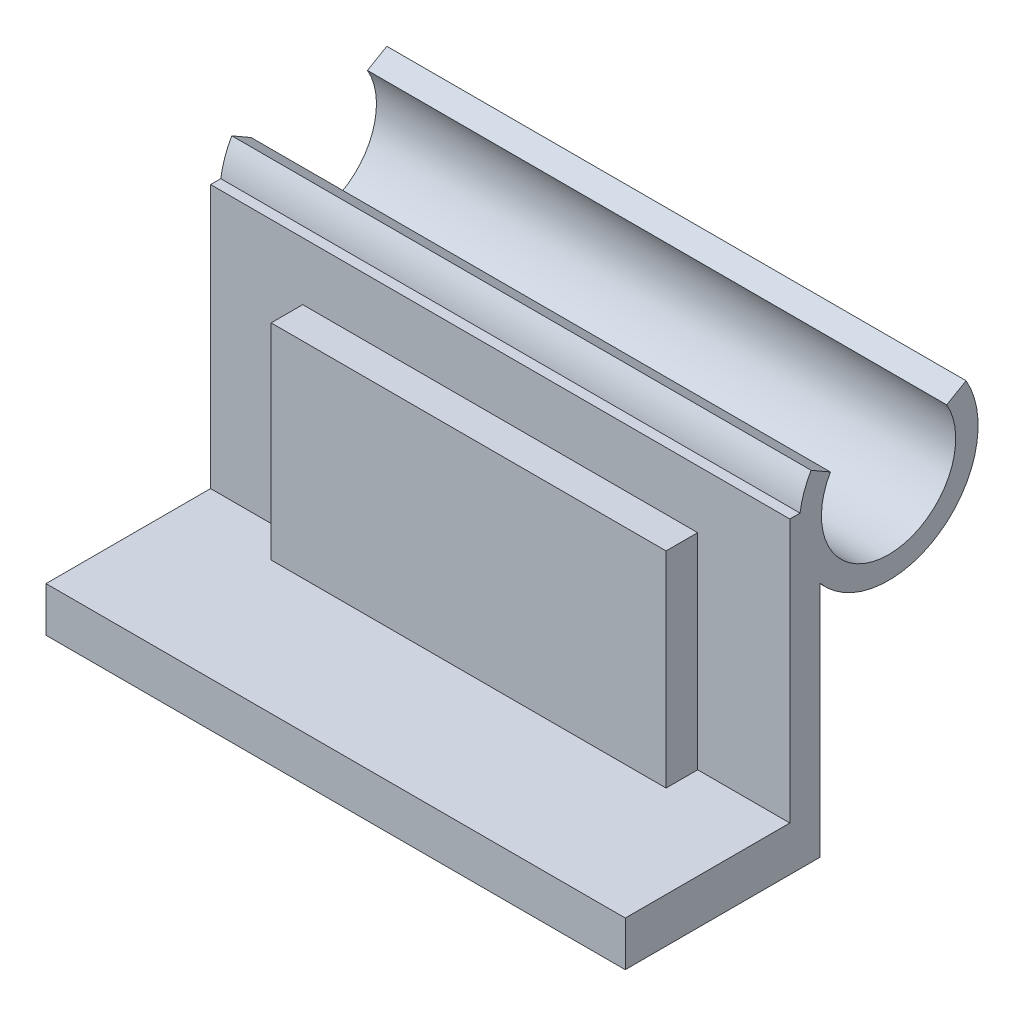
ISO-10303-21;
HEADER;
FILE_DESCRIPTION(('STEP AP214'),'2;1');
FILE_NAME('part.step','',(''),(''),'','','');
FILE_SCHEMA(('AUTOMOTIVE_DESIGN { 1 0 10303 214 1 1 1 1 }'));
ENDSEC;
DATA;
#1=APPLICATION_CONTEXT('core data for automotive mechanical design processes');
#2=APPLICATION_PROTOCOL_DEFINITION('international standard','automotive_design',2000,#1);
#3=PRODUCT_CONTEXT('',#1,'mechanical');
#4=PRODUCT('Part','Part','',(#3));
#5=PRODUCT_RELATED_PRODUCT_CATEGORY('part','',(#4));
#6=PRODUCT_DEFINITION_FORMATION('','',#4);
#7=PRODUCT_DEFINITION_CONTEXT('part definition',#1,'design');
#8=PRODUCT_DEFINITION('design','',#6,#7);
#9=PRODUCT_DEFINITION_SHAPE('','',#8);
#10=(LENGTH_UNIT() NAMED_UNIT(*) SI_UNIT(.MILLI.,.METRE.));
#11=(NAMED_UNIT(*) PLANE_ANGLE_UNIT() SI_UNIT($,.RADIAN.));
#12=(NAMED_UNIT(*) SI_UNIT($,.STERADIAN.) SOLID_ANGLE_UNIT());
#13=UNCERTAINTY_MEASURE_WITH_UNIT(LENGTH_MEASURE(1.E-05),#10,'distance_accuracy_value','');
#14=(GEOMETRIC_REPRESENTATION_CONTEXT(3) GLOBAL_UNCERTAINTY_ASSIGNED_CONTEXT((#13)) GLOBAL_UNIT_ASSIGNED_CONTEXT((#10,
#11,#12)) REPRESENTATION_CONTEXT('',''));
#15=CARTESIAN_POINT('',(0.,0.,0.));
#16=DIRECTION('',(0.,0.,1.));
#17=DIRECTION('',(1.,0.,0.));
#18=AXIS2_PLACEMENT_3D('',#15,#16,#17);
#19=CARTESIAN_POINT('',(-11.,0.5,3.75));
#20=DIRECTION('',(0.,0.,1.));
#21=DIRECTION('',(1.,0.,0.));
#22=AXIS2_PLACEMENT_3D('',#19,#20,#21);
#23=PLANE('',#22);
#24=DIRECTION('',(-1.,0.,0.));
#25=VECTOR('',#24,1.);
#26=CARTESIAN_POINT('',(-11.,-9.5,3.75));
#27=LINE('',#26,#25);
#28=CARTESIAN_POINT('',(-7.5,-9.5,3.75));
#29=VERTEX_POINT('',#28);
#30=CARTESIAN_POINT('',(-11.,-9.5,3.75));
#31=VERTEX_POINT('',#30);
#32=EDGE_CURVE('E237',#29,#31,#27,.T.);
#33=ORIENTED_EDGE('',*,*,#32,.F.);
#34=DIRECTION('',(0.,1.,0.));
#35=VECTOR('',#34,1.);
#36=CARTESIAN_POINT('',(-7.5,-9.5,3.75));
#37=LINE('',#36,#35);
#38=CARTESIAN_POINT('',(-7.5,-1.7,3.75));
#39=VERTEX_POINT('',#38);
#40=EDGE_CURVE('E53',#29,#39,#37,.T.);
#41=ORIENTED_EDGE('',*,*,#40,.T.);
#42=DIRECTION('',(1.,0.,0.));
#43=VECTOR('',#42,1.);
#44=CARTESIAN_POINT('',(-7.5,-1.7,3.75));
#45=LINE('',#44,#43);
#46=CARTESIAN_POINT('',(7.5,-1.7,3.75));
#47=VERTEX_POINT('',#46);
#48=EDGE_CURVE('E57',#39,#47,#45,.T.);
#49=ORIENTED_EDGE('',*,*,#48,.T.);
#50=DIRECTION('',(0.,1.,0.));
#51=VECTOR('',#50,1.);
#52=CARTESIAN_POINT('',(7.5,-9.5,3.75));
#53=LINE('',#52,#51);
#54=CARTESIAN_POINT('',(7.5,-9.5,3.75));
#55=VERTEX_POINT('',#54);
#56=EDGE_CURVE('E214',#55,#47,#53,.T.);
#57=ORIENTED_EDGE('',*,*,#56,.F.);
#58=CARTESIAN_POINT('',(11.,-9.5,3.75));
#59=VERTEX_POINT('',#58);
#60=EDGE_CURVE('E240',#59,#55,#27,.T.);
#61=ORIENTED_EDGE('',*,*,#60,.F.);
#62=DIRECTION('',(0.,-1.,0.));
#63=VECTOR('',#62,1.);
#64=CARTESIAN_POINT('',(11.,0.5,3.75));
#65=LINE('',#64,#63);
#66=CARTESIAN_POINT('',(11.,0.5,3.75));
#67=VERTEX_POINT('',#66);
#68=EDGE_CURVE('E242',#67,#59,#65,.T.);
#69=ORIENTED_EDGE('',*,*,#68,.F.);
#70=DIRECTION('',(1.,0.,0.));
#71=VECTOR('',#70,1.);
#72=CARTESIAN_POINT('',(-11.,0.5,3.75));
#73=LINE('',#72,#71);
#74=CARTESIAN_POINT('',(-11.,0.5,3.75));
#75=VERTEX_POINT('',#74);
#76=EDGE_CURVE('E11',#75,#67,#73,.T.);
#77=ORIENTED_EDGE('',*,*,#76,.F.);
#78=DIRECTION('',(0.,-1.,0.));
#79=VECTOR('',#78,1.);
#80=CARTESIAN_POINT('',(-11.,0.5,3.75));
#81=LINE('',#80,#79);
#82=EDGE_CURVE('E243',#75,#31,#81,.T.);
#83=ORIENTED_EDGE('',*,*,#82,.T.);
#84=EDGE_LOOP('',(#33,#41,#49,#57,#61,#69,#77,#83));
#85=FACE_BOUND('',#84,.T.);
#86=ADVANCED_FACE('F39',(#85),#23,.T.);
#87=CARTESIAN_POINT('',(-11.,-9.5,10.));
#88=DIRECTION('',(0.,1.,0.));
#89=DIRECTION('',(0.,0.,1.));
#90=AXIS2_PLACEMENT_3D('',#87,#88,#89);
#91=PLANE('',#90);
#92=DIRECTION('',(1.,0.,0.));
#93=VECTOR('',#92,1.);
#94=CARTESIAN_POINT('',(-7.5,-9.5,4.95));
#95=LINE('',#94,#93);
#96=CARTESIAN_POINT('',(-7.5,-9.5,4.95));
#97=VERTEX_POINT('',#96);
#98=CARTESIAN_POINT('',(7.5,-9.5,4.95));
#99=VERTEX_POINT('',#98);
#100=EDGE_CURVE('E208',#97,#99,#95,.T.);
#101=ORIENTED_EDGE('',*,*,#100,.F.);
#102=DIRECTION('',(0.,0.,-1.));
#103=VECTOR('',#102,1.);
#104=CARTESIAN_POINT('',(-7.5,-9.5,4.95));
#105=LINE('',#104,#103);
#106=EDGE_CURVE('E201',#97,#29,#105,.T.);
#107=ORIENTED_EDGE('',*,*,#106,.T.);
#108=ORIENTED_EDGE('',*,*,#32,.T.);
#109=DIRECTION('',(0.,0.,1.));
#110=VECTOR('',#109,1.);
#111=CARTESIAN_POINT('',(-11.,-9.5,10.));
#112=LINE('',#111,#110);
#113=CARTESIAN_POINT('',(-11.,-9.5,10.));
#114=VERTEX_POINT('',#113);
#115=EDGE_CURVE('E227',#31,#114,#112,.T.);
#116=ORIENTED_EDGE('',*,*,#115,.T.);
#117=DIRECTION('',(1.,0.,0.));
#118=VECTOR('',#117,1.);
#119=CARTESIAN_POINT('',(-11.,-9.5,10.));
#120=LINE('',#119,#118);
#121=CARTESIAN_POINT('',(11.,-9.5,10.));
#122=VERTEX_POINT('',#121);
#123=EDGE_CURVE('E234',#114,#122,#120,.T.);
#124=ORIENTED_EDGE('',*,*,#123,.T.);
#125=DIRECTION('',(0.,0.,1.));
#126=VECTOR('',#125,1.);
#127=CARTESIAN_POINT('',(11.,-9.5,10.));
#128=LINE('',#127,#126);
#129=EDGE_CURVE('E228',#59,#122,#128,.T.);
#130=ORIENTED_EDGE('',*,*,#129,.F.);
#131=ORIENTED_EDGE('',*,*,#60,.T.);
#132=DIRECTION('',(0.,0.,-1.));
#133=VECTOR('',#132,1.);
#134=CARTESIAN_POINT('',(7.5,-9.5,4.95));
#135=LINE('',#134,#133);
#136=EDGE_CURVE('E211',#99,#55,#135,.T.);
#137=ORIENTED_EDGE('',*,*,#136,.F.);
#138=EDGE_LOOP('',(#101,#107,#108,#116,#124,#130,#131,#137));
#139=FACE_BOUND('',#138,.T.);
#140=ADVANCED_FACE('F274',(#139),#91,.T.);
#141=CARTESIAN_POINT('',(-11.,0.5,2.6));
#142=DIRECTION('',(0.,1.,0.));
#143=DIRECTION('',(0.,0.,1.));
#144=AXIS2_PLACEMENT_3D('',#141,#142,#143);
#145=PLANE('',#144);
#146=DIRECTION('',(1.,0.,0.));
#147=VECTOR('',#146,1.);
#148=CARTESIAN_POINT('',(-11.,0.5,3.36303434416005));
#149=LINE('',#148,#147);
#150=CARTESIAN_POINT('',(-11.,0.5,3.36303434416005));
#151=VERTEX_POINT('',#150);
#152=CARTESIAN_POINT('',(11.,0.5,3.36303434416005));
#153=VERTEX_POINT('',#152);
#154=EDGE_CURVE('E195',#151,#153,#149,.T.);
#155=ORIENTED_EDGE('',*,*,#154,.F.);
#156=DIRECTION('',(0.,0.,1.));
#157=VECTOR('',#156,1.);
#158=CARTESIAN_POINT('',(-11.,0.5,2.6));
#159=LINE('',#158,#157);
#160=EDGE_CURVE('E252',#151,#75,#159,.T.);
#161=ORIENTED_EDGE('',*,*,#160,.T.);
#162=ORIENTED_EDGE('',*,*,#76,.T.);
#163=DIRECTION('',(0.,0.,1.));
#164=VECTOR('',#163,1.);
#165=CARTESIAN_POINT('',(11.,0.5,2.6));
#166=LINE('',#165,#164);
#167=EDGE_CURVE('E247',#153,#67,#166,.T.);
#168=ORIENTED_EDGE('',*,*,#167,.F.);
#169=EDGE_LOOP('',(#155,#161,#162,#168));
#170=FACE_BOUND('',#169,.T.);
#171=ADVANCED_FACE('F270',(#170),#145,.T.);
#172=CARTESIAN_POINT('',(-11.,-11.2,2.6));
#173=DIRECTION('',(0.,0.,-1.));
#174=DIRECTION('',(-1.,0.,0.));
#175=AXIS2_PLACEMENT_3D('',#172,#173,#174);
#176=PLANE('',#175);
#177=DIRECTION('',(1.,0.,0.));
#178=VECTOR('',#177,1.);
#179=CARTESIAN_POINT('',(-11.,-2.19089023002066,2.6));
#180=LINE('',#179,#178);
#181=CARTESIAN_POINT('',(11.,-2.19089023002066,2.6));
#182=VERTEX_POINT('',#181);
#183=CARTESIAN_POINT('',(-11.,-2.19089023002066,2.6));
#184=VERTEX_POINT('',#183);
#185=EDGE_CURVE('E151',#182,#184,#180,.F.);
#186=ORIENTED_EDGE('',*,*,#185,.F.);
#187=DIRECTION('',(0.,1.,0.));
#188=VECTOR('',#187,1.);
#189=CARTESIAN_POINT('',(11.,-11.2,2.6));
#190=LINE('',#189,#188);
#191=CARTESIAN_POINT('',(11.,-11.2,2.6));
#192=VERTEX_POINT('',#191);
#193=EDGE_CURVE('E259',#192,#182,#190,.T.);
#194=ORIENTED_EDGE('',*,*,#193,.F.);
#195=DIRECTION('',(1.,0.,0.));
#196=VECTOR('',#195,1.);
#197=CARTESIAN_POINT('',(-11.,-11.2,2.6));
#198=LINE('',#197,#196);
#199=CARTESIAN_POINT('',(-11.,-11.2,2.6));
#200=VERTEX_POINT('',#199);
#201=EDGE_CURVE('E42',#200,#192,#198,.T.);
#202=ORIENTED_EDGE('',*,*,#201,.F.);
#203=DIRECTION('',(0.,1.,0.));
#204=VECTOR('',#203,1.);
#205=CARTESIAN_POINT('',(-11.,-11.2,2.6));
#206=LINE('',#205,#204);
#207=EDGE_CURVE('E250',#200,#184,#206,.T.);
#208=ORIENTED_EDGE('',*,*,#207,.T.);
#209=EDGE_LOOP('',(#186,#194,#202,#208));
#210=FACE_BOUND('',#209,.T.);
#211=ADVANCED_FACE('F285',(#210),#176,.T.);
#212=CARTESIAN_POINT('',(-11.,-11.2,3.75));
#213=DIRECTION('',(0.,-1.,0.));
#214=DIRECTION('',(0.,0.,-1.));
#215=AXIS2_PLACEMENT_3D('',#212,#213,#214);
#216=PLANE('',#215);
#217=DIRECTION('',(0.,0.,-1.));
#218=VECTOR('',#217,1.);
#219=CARTESIAN_POINT('',(11.,-11.2,3.75));
#220=LINE('',#219,#218);
#221=CARTESIAN_POINT('',(11.,-11.2,10.));
#222=VERTEX_POINT('',#221);
#223=EDGE_CURVE('E256',#222,#192,#220,.T.);
#224=ORIENTED_EDGE('',*,*,#223,.F.);
#225=DIRECTION('',(1.,0.,0.));
#226=VECTOR('',#225,1.);
#227=CARTESIAN_POINT('',(-11.,-11.2,10.));
#228=LINE('',#227,#226);
#229=CARTESIAN_POINT('',(-11.,-11.2,10.));
#230=VERTEX_POINT('',#229);
#231=EDGE_CURVE('E230',#230,#222,#228,.T.);
#232=ORIENTED_EDGE('',*,*,#231,.F.);
#233=DIRECTION('',(0.,0.,-1.));
#234=VECTOR('',#233,1.);
#235=CARTESIAN_POINT('',(-11.,-11.2,3.75));
#236=LINE('',#235,#234);
#237=EDGE_CURVE('E246',#230,#200,#236,.T.);
#238=ORIENTED_EDGE('',*,*,#237,.T.);
#239=ORIENTED_EDGE('',*,*,#201,.T.);
#240=EDGE_LOOP('',(#224,#232,#238,#239));
#241=FACE_BOUND('',#240,.T.);
#242=ADVANCED_FACE('F282',(#241),#216,.T.);
#243=CARTESIAN_POINT('',(-11.,0.,0.));
#244=DIRECTION('',(1.,0.,0.));
#245=DIRECTION('',(0.,0.,-1.));
#246=AXIS2_PLACEMENT_3D('',#243,#244,#245);
#247=PLANE('',#246);
#248=ORIENTED_EDGE('',*,*,#160,.F.);
#249=CARTESIAN_POINT('',(-11.,0.,0.));
#250=DIRECTION('',(1.,0.,0.));
#251=DIRECTION('',(0.,0.,-1.));
#252=AXIS2_PLACEMENT_3D('',#249,#250,#251);
#253=CIRCLE('',#252,3.4);
#254=CARTESIAN_POINT('',(-11.,1.7,2.94448637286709));
#255=VERTEX_POINT('',#254);
#256=EDGE_CURVE('E156',#255,#151,#253,.T.);
#257=ORIENTED_EDGE('',*,*,#256,.F.);
#258=DIRECTION('',(0.,0.5,0.866025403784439));
#259=VECTOR('',#258,1.);
#260=CARTESIAN_POINT('',(-11.,1.275,2.20836477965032));
#261=LINE('',#260,#259);
#262=CARTESIAN_POINT('',(-11.,1.275,2.20836477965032));
#263=VERTEX_POINT('',#262);
#264=EDGE_CURVE('E166',#263,#255,#261,.T.);
#265=ORIENTED_EDGE('',*,*,#264,.F.);
#266=CARTESIAN_POINT('',(-11.,0.,0.));
#267=DIRECTION('',(-1.,0.,0.));
#268=DIRECTION('',(0.,0.,1.));
#269=AXIS2_PLACEMENT_3D('',#266,#267,#268);
#270=CIRCLE('',#269,2.55);
#271=CARTESIAN_POINT('',(-11.,1.275,-2.20836477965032));
#272=VERTEX_POINT('',#271);
#273=EDGE_CURVE('E173',#272,#263,#270,.T.);
#274=ORIENTED_EDGE('',*,*,#273,.F.);
#275=DIRECTION('',(0.,-0.5,0.866025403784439));
#276=VECTOR('',#275,1.);
#277=CARTESIAN_POINT('',(-11.,1.7,-2.94448637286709));
#278=LINE('',#277,#276);
#279=CARTESIAN_POINT('',(-11.,1.7,-2.94448637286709));
#280=VERTEX_POINT('',#279);
#281=EDGE_CURVE('E162',#280,#272,#278,.T.);
#282=ORIENTED_EDGE('',*,*,#281,.F.);
#283=EDGE_CURVE('E145',#184,#280,#253,.T.);
#284=ORIENTED_EDGE('',*,*,#283,.F.);
#285=ORIENTED_EDGE('',*,*,#207,.F.);
#286=ORIENTED_EDGE('',*,*,#237,.F.);
#287=DIRECTION('',(0.,-1.,0.));
#288=VECTOR('',#287,1.);
#289=CARTESIAN_POINT('',(-11.,-11.2,10.));
#290=LINE('',#289,#288);
#291=EDGE_CURVE('E224',#114,#230,#290,.T.);
#292=ORIENTED_EDGE('',*,*,#291,.F.);
#293=ORIENTED_EDGE('',*,*,#115,.F.);
#294=ORIENTED_EDGE('',*,*,#82,.F.);
#295=EDGE_LOOP('',(#248,#257,#265,#274,#282,#284,#285,#286,#292,#293,#294));
#296=FACE_BOUND('',#295,.T.);
#297=ADVANCED_FACE('F170',(#296),#247,.F.);
#298=CARTESIAN_POINT('',(11.,0.,0.));
#299=DIRECTION('',(1.,0.,0.));
#300=DIRECTION('',(0.,0.,-1.));
#301=AXIS2_PLACEMENT_3D('',#298,#299,#300);
#302=PLANE('',#301);
#303=CARTESIAN_POINT('',(11.,0.,0.));
#304=DIRECTION('',(1.,0.,0.));
#305=DIRECTION('',(0.,0.,-1.));
#306=AXIS2_PLACEMENT_3D('',#303,#304,#305);
#307=CIRCLE('',#306,3.4);
#308=CARTESIAN_POINT('',(11.,1.7,2.94448637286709));
#309=VERTEX_POINT('',#308);
#310=EDGE_CURVE('E179',#309,#153,#307,.T.);
#311=ORIENTED_EDGE('',*,*,#310,.T.);
#312=ORIENTED_EDGE('',*,*,#167,.T.);
#313=ORIENTED_EDGE('',*,*,#68,.T.);
#314=ORIENTED_EDGE('',*,*,#129,.T.);
#315=DIRECTION('',(0.,-1.,0.));
#316=VECTOR('',#315,1.);
#317=CARTESIAN_POINT('',(11.,-11.2,10.));
#318=LINE('',#317,#316);
#319=EDGE_CURVE('E220',#122,#222,#318,.T.);
#320=ORIENTED_EDGE('',*,*,#319,.T.);
#321=ORIENTED_EDGE('',*,*,#223,.T.);
#322=ORIENTED_EDGE('',*,*,#193,.T.);
#323=CARTESIAN_POINT('',(11.,1.7,-2.94448637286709));
#324=VERTEX_POINT('',#323);
#325=EDGE_CURVE('E182',#182,#324,#307,.T.);
#326=ORIENTED_EDGE('',*,*,#325,.T.);
#327=DIRECTION('',(0.,-0.5,0.866025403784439));
#328=VECTOR('',#327,1.);
#329=CARTESIAN_POINT('',(11.,1.7,-2.94448637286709));
#330=LINE('',#329,#328);
#331=CARTESIAN_POINT('',(11.,1.275,-2.20836477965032));
#332=VERTEX_POINT('',#331);
#333=EDGE_CURVE('E164',#324,#332,#330,.T.);
#334=ORIENTED_EDGE('',*,*,#333,.T.);
#335=CARTESIAN_POINT('',(11.,0.,0.));
#336=DIRECTION('',(-1.,0.,0.));
#337=DIRECTION('',(0.,0.,1.));
#338=AXIS2_PLACEMENT_3D('',#335,#336,#337);
#339=CIRCLE('',#338,2.55);
#340=CARTESIAN_POINT('',(11.,1.275,2.20836477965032));
#341=VERTEX_POINT('',#340);
#342=EDGE_CURVE('E184',#332,#341,#339,.T.);
#343=ORIENTED_EDGE('',*,*,#342,.T.);
#344=DIRECTION('',(0.,0.5,0.866025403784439));
#345=VECTOR('',#344,1.);
#346=CARTESIAN_POINT('',(11.,1.275,2.20836477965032));
#347=LINE('',#346,#345);
#348=EDGE_CURVE('E157',#341,#309,#347,.T.);
#349=ORIENTED_EDGE('',*,*,#348,.T.);
#350=EDGE_LOOP('',(#311,#312,#313,#314,#320,#321,#322,#326,#334,#343,#349));
#351=FACE_BOUND('',#350,.T.);
#352=ADVANCED_FACE('F264',(#351),#302,.T.);
#353=CARTESIAN_POINT('',(-11.,-11.2,10.));
#354=DIRECTION('',(0.,0.,1.));
#355=DIRECTION('',(1.,0.,0.));
#356=AXIS2_PLACEMENT_3D('',#353,#354,#355);
#357=PLANE('',#356);
#358=ORIENTED_EDGE('',*,*,#319,.F.);
#359=ORIENTED_EDGE('',*,*,#123,.F.);
#360=ORIENTED_EDGE('',*,*,#291,.T.);
#361=ORIENTED_EDGE('',*,*,#231,.T.);
#362=EDGE_LOOP('',(#358,#359,#360,#361));
#363=FACE_BOUND('',#362,.T.);
#364=ADVANCED_FACE('F278',(#363),#357,.T.);
#365=CARTESIAN_POINT('',(-7.5,-1.7,4.95));
#366=DIRECTION('',(0.,0.,1.));
#367=DIRECTION('',(1.,0.,0.));
#368=AXIS2_PLACEMENT_3D('',#365,#366,#367);
#369=PLANE('',#368);
#370=DIRECTION('',(0.,-1.,0.));
#371=VECTOR('',#370,1.);
#372=CARTESIAN_POINT('',(7.5,-1.7,4.95));
#373=LINE('',#372,#371);
#374=CARTESIAN_POINT('',(7.5,-1.7,4.95));
#375=VERTEX_POINT('',#374);
#376=EDGE_CURVE('E197',#375,#99,#373,.T.);
#377=ORIENTED_EDGE('',*,*,#376,.F.);
#378=DIRECTION('',(1.,0.,0.));
#379=VECTOR('',#378,1.);
#380=CARTESIAN_POINT('',(-7.5,-1.7,4.95));
#381=LINE('',#380,#379);
#382=CARTESIAN_POINT('',(-7.5,-1.7,4.95));
#383=VERTEX_POINT('',#382);
#384=EDGE_CURVE('E218',#383,#375,#381,.T.);
#385=ORIENTED_EDGE('',*,*,#384,.F.);
#386=DIRECTION('',(0.,-1.,0.));
#387=VECTOR('',#386,1.);
#388=CARTESIAN_POINT('',(-7.5,-1.7,4.95));
#389=LINE('',#388,#387);
#390=EDGE_CURVE('E198',#383,#97,#389,.T.);
#391=ORIENTED_EDGE('',*,*,#390,.T.);
#392=ORIENTED_EDGE('',*,*,#100,.T.);
#393=EDGE_LOOP('',(#377,#385,#391,#392));
#394=FACE_BOUND('',#393,.T.);
#395=ADVANCED_FACE('F307',(#394),#369,.T.);
#396=CARTESIAN_POINT('',(-7.5,-1.7,3.75));
#397=DIRECTION('',(0.,1.,0.));
#398=DIRECTION('',(0.,0.,1.));
#399=AXIS2_PLACEMENT_3D('',#396,#397,#398);
#400=PLANE('',#399);
#401=DIRECTION('',(0.,0.,1.));
#402=VECTOR('',#401,1.);
#403=CARTESIAN_POINT('',(7.5,-1.7,3.75));
#404=LINE('',#403,#402);
#405=EDGE_CURVE('E202',#47,#375,#404,.T.);
#406=ORIENTED_EDGE('',*,*,#405,.F.);
#407=ORIENTED_EDGE('',*,*,#48,.F.);
#408=DIRECTION('',(0.,0.,1.));
#409=VECTOR('',#408,1.);
#410=CARTESIAN_POINT('',(-7.5,-1.7,3.75));
#411=LINE('',#410,#409);
#412=EDGE_CURVE('E205',#39,#383,#411,.T.);
#413=ORIENTED_EDGE('',*,*,#412,.T.);
#414=ORIENTED_EDGE('',*,*,#384,.T.);
#415=EDGE_LOOP('',(#406,#407,#413,#414));
#416=FACE_BOUND('',#415,.T.);
#417=ADVANCED_FACE('F302',(#416),#400,.T.);
#418=CARTESIAN_POINT('',(-7.5,0.,0.));
#419=DIRECTION('',(1.,0.,0.));
#420=DIRECTION('',(0.,0.,-1.));
#421=AXIS2_PLACEMENT_3D('',#418,#419,#420);
#422=PLANE('',#421);
#423=ORIENTED_EDGE('',*,*,#390,.F.);
#424=ORIENTED_EDGE('',*,*,#412,.F.);
#425=ORIENTED_EDGE('',*,*,#40,.F.);
#426=ORIENTED_EDGE('',*,*,#106,.F.);
#427=EDGE_LOOP('',(#423,#424,#425,#426));
#428=FACE_BOUND('',#427,.T.);
#429=ADVANCED_FACE('F299',(#428),#422,.F.);
#430=CARTESIAN_POINT('',(7.5,0.,0.));
#431=DIRECTION('',(1.,0.,0.));
#432=DIRECTION('',(0.,0.,-1.));
#433=AXIS2_PLACEMENT_3D('',#430,#431,#432);
#434=PLANE('',#433);
#435=ORIENTED_EDGE('',*,*,#376,.T.);
#436=ORIENTED_EDGE('',*,*,#136,.T.);
#437=ORIENTED_EDGE('',*,*,#56,.T.);
#438=ORIENTED_EDGE('',*,*,#405,.T.);
#439=EDGE_LOOP('',(#435,#436,#437,#438));
#440=FACE_BOUND('',#439,.T.);
#441=ADVANCED_FACE('F305',(#440),#434,.T.);
#442=CARTESIAN_POINT('',(-11.,0.,0.));
#443=DIRECTION('',(1.,0.,0.));
#444=DIRECTION('',(0.,0.,-1.));
#445=AXIS2_PLACEMENT_3D('',#442,#443,#444);
#446=CYLINDRICAL_SURFACE('',#445,3.4);
#447=ORIENTED_EDGE('',*,*,#256,.T.);
#448=ORIENTED_EDGE('',*,*,#154,.T.);
#449=ORIENTED_EDGE('',*,*,#310,.F.);
#450=DIRECTION('',(1.,0.,0.));
#451=VECTOR('',#450,1.);
#452=CARTESIAN_POINT('',(-11.,1.7,2.94448637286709));
#453=LINE('',#452,#451);
#454=EDGE_CURVE('E189',#255,#309,#453,.T.);
#455=ORIENTED_EDGE('',*,*,#454,.F.);
#456=EDGE_LOOP('',(#447,#448,#449,#455));
#457=FACE_BOUND('',#456,.T.);
#458=ADVANCED_FACE('F293',(#457),#446,.T.);
#459=ORIENTED_EDGE('',*,*,#325,.F.);
#460=ORIENTED_EDGE('',*,*,#185,.T.);
#461=ORIENTED_EDGE('',*,*,#283,.T.);
#462=DIRECTION('',(1.,0.,0.));
#463=VECTOR('',#462,1.);
#464=CARTESIAN_POINT('',(-11.,1.7,-2.94448637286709));
#465=LINE('',#464,#463);
#466=EDGE_CURVE('E148',#280,#324,#465,.T.);
#467=ORIENTED_EDGE('',*,*,#466,.T.);
#468=EDGE_LOOP('',(#459,#460,#461,#467));
#469=FACE_BOUND('',#468,.T.);
#470=ADVANCED_FACE('F147',(#469),#446,.T.);
#471=CARTESIAN_POINT('',(-11.,1.275,2.20836477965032));
#472=DIRECTION('',(0.,0.866025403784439,-0.5));
#473=DIRECTION('',(0.,0.5,0.866025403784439));
#474=AXIS2_PLACEMENT_3D('',#471,#472,#473);
#475=PLANE('',#474);
#476=ORIENTED_EDGE('',*,*,#348,.F.);
#477=DIRECTION('',(1.,0.,0.));
#478=VECTOR('',#477,1.);
#479=CARTESIAN_POINT('',(-11.,1.275,2.20836477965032));
#480=LINE('',#479,#478);
#481=EDGE_CURVE('E191',#263,#341,#480,.T.);
#482=ORIENTED_EDGE('',*,*,#481,.F.);
#483=ORIENTED_EDGE('',*,*,#264,.T.);
#484=ORIENTED_EDGE('',*,*,#454,.T.);
#485=EDGE_LOOP('',(#476,#482,#483,#484));
#486=FACE_BOUND('',#485,.T.);
#487=ADVANCED_FACE('F290',(#486),#475,.T.);
#488=CARTESIAN_POINT('',(-11.,0.,0.));
#489=DIRECTION('',(1.,0.,0.));
#490=DIRECTION('',(0.,0.,-1.));
#491=AXIS2_PLACEMENT_3D('',#488,#489,#490);
#492=CYLINDRICAL_SURFACE('',#491,2.55);
#493=ORIENTED_EDGE('',*,*,#342,.F.);
#494=DIRECTION('',(1.,0.,0.));
#495=VECTOR('',#494,1.);
#496=CARTESIAN_POINT('',(-11.,1.275,-2.20836477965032));
#497=LINE('',#496,#495);
#498=EDGE_CURVE('E165',#272,#332,#497,.T.);
#499=ORIENTED_EDGE('',*,*,#498,.F.);
#500=ORIENTED_EDGE('',*,*,#273,.T.);
#501=ORIENTED_EDGE('',*,*,#481,.T.);
#502=EDGE_LOOP('',(#493,#499,#500,#501));
#503=FACE_BOUND('',#502,.T.);
#504=ADVANCED_FACE('F455',(#503),#492,.F.);
#505=CARTESIAN_POINT('',(-11.,1.7,-2.94448637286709));
#506=DIRECTION('',(0.,0.866025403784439,0.5));
#507=DIRECTION('',(0.,-0.5,0.866025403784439));
#508=AXIS2_PLACEMENT_3D('',#505,#506,#507);
#509=PLANE('',#508);
#510=ORIENTED_EDGE('',*,*,#333,.F.);
#511=ORIENTED_EDGE('',*,*,#466,.F.);
#512=ORIENTED_EDGE('',*,*,#281,.T.);
#513=ORIENTED_EDGE('',*,*,#498,.T.);
#514=EDGE_LOOP('',(#510,#511,#512,#513));
#515=FACE_BOUND('',#514,.T.);
#516=ADVANCED_FACE('F161',(#515),#509,.T.);
#517=CLOSED_SHELL('',(#86,#140,#171,#211,#242,#297,#352,#364,#395,#417,#429,#441,#458,#470,#487,
#504,#516));
#518=MANIFOLD_SOLID_BREP('B2',#517);
#519=ADVANCED_BREP_SHAPE_REPRESENTATION('',(#18,#518),#14);
#520=SHAPE_DEFINITION_REPRESENTATION(#9,#519);
ENDSEC;
END-ISO-10303-21;
